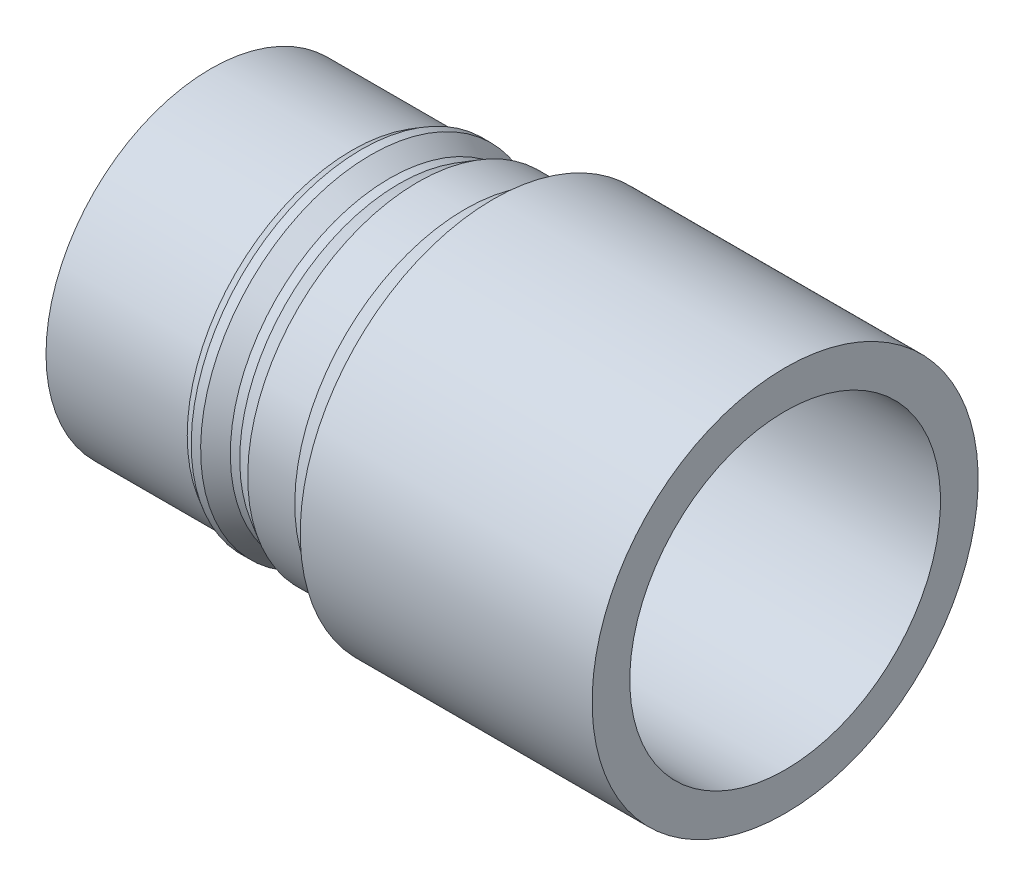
ISO-10303-21;
HEADER;
FILE_DESCRIPTION(('STEP AP214'),'2;1');
FILE_NAME('part.step','',(''),(''),'','','');
FILE_SCHEMA(('AUTOMOTIVE_DESIGN { 1 0 10303 214 1 1 1 1 }'));
ENDSEC;
DATA;
#1=APPLICATION_CONTEXT('core data for automotive mechanical design processes');
#2=APPLICATION_PROTOCOL_DEFINITION('international standard','automotive_design',2000,#1);
#3=PRODUCT_CONTEXT('',#1,'mechanical');
#4=PRODUCT('Part','Part','',(#3));
#5=PRODUCT_RELATED_PRODUCT_CATEGORY('part','',(#4));
#6=PRODUCT_DEFINITION_FORMATION('','',#4);
#7=PRODUCT_DEFINITION_CONTEXT('part definition',#1,'design');
#8=PRODUCT_DEFINITION('design','',#6,#7);
#9=PRODUCT_DEFINITION_SHAPE('','',#8);
#10=(LENGTH_UNIT() NAMED_UNIT(*) SI_UNIT(.MILLI.,.METRE.));
#11=(NAMED_UNIT(*) PLANE_ANGLE_UNIT() SI_UNIT($,.RADIAN.));
#12=(NAMED_UNIT(*) SI_UNIT($,.STERADIAN.) SOLID_ANGLE_UNIT());
#13=UNCERTAINTY_MEASURE_WITH_UNIT(LENGTH_MEASURE(1.E-05),#10,'distance_accuracy_value','');
#14=(GEOMETRIC_REPRESENTATION_CONTEXT(3) GLOBAL_UNCERTAINTY_ASSIGNED_CONTEXT((#13)) GLOBAL_UNIT_ASSIGNED_CONTEXT((#10,
#11,#12)) REPRESENTATION_CONTEXT('',''));
#15=CARTESIAN_POINT('',(0.,0.,0.));
#16=DIRECTION('',(0.,0.,1.));
#17=DIRECTION('',(1.,0.,0.));
#18=AXIS2_PLACEMENT_3D('',#15,#16,#17);
#19=CARTESIAN_POINT('',(0.,0.,0.));
#20=DIRECTION('',(-1.,0.,0.));
#21=DIRECTION('',(0.,-1.,0.));
#22=AXIS2_PLACEMENT_3D('',#19,#20,#21);
#23=PLANE('',#22);
#24=CARTESIAN_POINT('',(0.,0.,0.));
#25=DIRECTION('',(1.,0.,0.));
#26=DIRECTION('',(0.,1.,0.));
#27=AXIS2_PLACEMENT_3D('',#24,#25,#26);
#28=CIRCLE('',#27,16.5);
#29=CARTESIAN_POINT('',(0.,16.5,0.));
#30=VERTEX_POINT('',#29);
#31=EDGE_CURVE('E69',#30,#30,#28,.T.);
#32=ORIENTED_EDGE('',*,*,#31,.T.);
#33=EDGE_LOOP('',(#32));
#34=FACE_BOUND('',#33,.T.);
#35=CARTESIAN_POINT('',(0.,0.,0.));
#36=DIRECTION('',(1.,0.,0.));
#37=DIRECTION('',(0.,1.,0.));
#38=AXIS2_PLACEMENT_3D('',#35,#36,#37);
#39=CIRCLE('',#38,17.5);
#40=CARTESIAN_POINT('',(0.,17.5,0.));
#41=VERTEX_POINT('',#40);
#42=EDGE_CURVE('E10',#41,#41,#39,.T.);
#43=ORIENTED_EDGE('',*,*,#42,.F.);
#44=EDGE_LOOP('',(#43));
#45=FACE_BOUND('',#44,.T.);
#46=ADVANCED_FACE('F31',(#34,#45),#23,.T.);
#47=CARTESIAN_POINT('',(30.,0.,0.));
#48=DIRECTION('',(1.,0.,0.));
#49=DIRECTION('',(0.,1.,0.));
#50=AXIS2_PLACEMENT_3D('',#47,#48,#49);
#51=CYLINDRICAL_SURFACE('',#50,17.5);
#52=ORIENTED_EDGE('',*,*,#42,.T.);
#53=EDGE_LOOP('',(#52));
#54=FACE_BOUND('',#53,.T.);
#55=CARTESIAN_POINT('',(15.,0.,0.));
#56=DIRECTION('',(1.,0.,0.));
#57=DIRECTION('',(0.,1.,0.));
#58=AXIS2_PLACEMENT_3D('',#55,#56,#57);
#59=CIRCLE('',#58,17.5);
#60=CARTESIAN_POINT('',(15.,17.5,0.));
#61=VERTEX_POINT('',#60);
#62=EDGE_CURVE('E37',#61,#61,#59,.T.);
#63=ORIENTED_EDGE('',*,*,#62,.F.);
#64=EDGE_LOOP('',(#63));
#65=FACE_BOUND('',#64,.T.);
#66=ADVANCED_FACE('F106',(#54,#65),#51,.T.);
#67=CARTESIAN_POINT('',(16.,0.,0.));
#68=DIRECTION('',(1.,0.,0.));
#69=DIRECTION('',(0.,1.,0.));
#70=AXIS2_PLACEMENT_3D('',#67,#68,#69);
#71=CONICAL_SURFACE('',#70,18.0773502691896,0.523598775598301);
#72=ORIENTED_EDGE('',*,*,#62,.T.);
#73=EDGE_LOOP('',(#72));
#74=FACE_BOUND('',#73,.T.);
#75=CARTESIAN_POINT('',(16.,0.,0.));
#76=DIRECTION('',(1.,0.,0.));
#77=DIRECTION('',(0.,1.,0.));
#78=AXIS2_PLACEMENT_3D('',#75,#76,#77);
#79=CIRCLE('',#78,18.0773502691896);
#80=CARTESIAN_POINT('',(16.,18.0773502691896,0.));
#81=VERTEX_POINT('',#80);
#82=EDGE_CURVE('E41',#81,#81,#79,.T.);
#83=ORIENTED_EDGE('',*,*,#82,.F.);
#84=EDGE_LOOP('',(#83));
#85=FACE_BOUND('',#84,.T.);
#86=ADVANCED_FACE('F110',(#74,#85),#71,.T.);
#87=CARTESIAN_POINT('',(30.,0.,0.));
#88=DIRECTION('',(1.,0.,0.));
#89=DIRECTION('',(0.,1.,0.));
#90=AXIS2_PLACEMENT_3D('',#87,#88,#89);
#91=CYLINDRICAL_SURFACE('',#90,18.0773502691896);
#92=ORIENTED_EDGE('',*,*,#82,.T.);
#93=EDGE_LOOP('',(#92));
#94=FACE_BOUND('',#93,.T.);
#95=CARTESIAN_POINT('',(17.,0.,0.));
#96=DIRECTION('',(1.,0.,0.));
#97=DIRECTION('',(0.,1.,0.));
#98=AXIS2_PLACEMENT_3D('',#95,#96,#97);
#99=CIRCLE('',#98,18.0773502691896);
#100=CARTESIAN_POINT('',(17.,18.0773502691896,0.));
#101=VERTEX_POINT('',#100);
#102=EDGE_CURVE('E45',#101,#101,#99,.T.);
#103=ORIENTED_EDGE('',*,*,#102,.F.);
#104=EDGE_LOOP('',(#103));
#105=FACE_BOUND('',#104,.T.);
#106=ADVANCED_FACE('F114',(#94,#105),#91,.T.);
#107=CARTESIAN_POINT('',(19.,0.,0.));
#108=DIRECTION('',(-1.,0.,0.));
#109=DIRECTION('',(0.,-1.,0.));
#110=AXIS2_PLACEMENT_3D('',#107,#108,#109);
#111=CONICAL_SURFACE('',#110,16.9226497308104,0.523598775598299);
#112=ORIENTED_EDGE('',*,*,#102,.T.);
#113=EDGE_LOOP('',(#112));
#114=FACE_BOUND('',#113,.T.);
#115=CARTESIAN_POINT('',(19.,0.,0.));
#116=DIRECTION('',(1.,0.,0.));
#117=DIRECTION('',(0.,1.,0.));
#118=AXIS2_PLACEMENT_3D('',#115,#116,#117);
#119=CIRCLE('',#118,16.9226497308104);
#120=CARTESIAN_POINT('',(19.,16.9226497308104,0.));
#121=VERTEX_POINT('',#120);
#122=EDGE_CURVE('E50',#121,#121,#119,.T.);
#123=ORIENTED_EDGE('',*,*,#122,.F.);
#124=EDGE_LOOP('',(#123));
#125=FACE_BOUND('',#124,.T.);
#126=ADVANCED_FACE('F120',(#114,#125),#111,.T.);
#127=CARTESIAN_POINT('',(30.,0.,0.));
#128=DIRECTION('',(1.,0.,0.));
#129=DIRECTION('',(0.,1.,0.));
#130=AXIS2_PLACEMENT_3D('',#127,#128,#129);
#131=CYLINDRICAL_SURFACE('',#130,16.9226497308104);
#132=ORIENTED_EDGE('',*,*,#122,.T.);
#133=EDGE_LOOP('',(#132));
#134=FACE_BOUND('',#133,.T.);
#135=CARTESIAN_POINT('',(20.,0.,0.));
#136=DIRECTION('',(1.,0.,0.));
#137=DIRECTION('',(0.,1.,0.));
#138=AXIS2_PLACEMENT_3D('',#135,#136,#137);
#139=CIRCLE('',#138,16.9226497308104);
#140=CARTESIAN_POINT('',(20.,16.9226497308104,0.));
#141=VERTEX_POINT('',#140);
#142=EDGE_CURVE('E53',#141,#141,#139,.T.);
#143=ORIENTED_EDGE('',*,*,#142,.F.);
#144=EDGE_LOOP('',(#143));
#145=FACE_BOUND('',#144,.T.);
#146=ADVANCED_FACE('F124',(#134,#145),#131,.T.);
#147=CARTESIAN_POINT('',(22.,0.,0.));
#148=DIRECTION('',(1.,0.,0.));
#149=DIRECTION('',(0.,1.,0.));
#150=AXIS2_PLACEMENT_3D('',#147,#148,#149);
#151=CONICAL_SURFACE('',#150,18.0773502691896,0.523598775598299);
#152=ORIENTED_EDGE('',*,*,#142,.T.);
#153=EDGE_LOOP('',(#152));
#154=FACE_BOUND('',#153,.T.);
#155=CARTESIAN_POINT('',(22.,0.,0.));
#156=DIRECTION('',(1.,0.,0.));
#157=DIRECTION('',(0.,1.,0.));
#158=AXIS2_PLACEMENT_3D('',#155,#156,#157);
#159=CIRCLE('',#158,18.0773502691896);
#160=CARTESIAN_POINT('',(22.,18.0773502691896,0.));
#161=VERTEX_POINT('',#160);
#162=EDGE_CURVE('E56',#161,#161,#159,.T.);
#163=ORIENTED_EDGE('',*,*,#162,.F.);
#164=EDGE_LOOP('',(#163));
#165=FACE_BOUND('',#164,.T.);
#166=ADVANCED_FACE('F128',(#154,#165),#151,.T.);
#167=CARTESIAN_POINT('',(30.,0.,0.));
#168=DIRECTION('',(1.,0.,0.));
#169=DIRECTION('',(0.,1.,0.));
#170=AXIS2_PLACEMENT_3D('',#167,#168,#169);
#171=CYLINDRICAL_SURFACE('',#170,18.0773502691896);
#172=ORIENTED_EDGE('',*,*,#162,.T.);
#173=EDGE_LOOP('',(#172));
#174=FACE_BOUND('',#173,.T.);
#175=CARTESIAN_POINT('',(27.,0.,0.));
#176=DIRECTION('',(1.,0.,0.));
#177=DIRECTION('',(0.,1.,0.));
#178=AXIS2_PLACEMENT_3D('',#175,#176,#177);
#179=CIRCLE('',#178,18.0773502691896);
#180=CARTESIAN_POINT('',(27.,18.0773502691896,0.));
#181=VERTEX_POINT('',#180);
#182=EDGE_CURVE('E59',#181,#181,#179,.T.);
#183=ORIENTED_EDGE('',*,*,#182,.F.);
#184=EDGE_LOOP('',(#183));
#185=FACE_BOUND('',#184,.T.);
#186=ADVANCED_FACE('F132',(#174,#185),#171,.T.);
#187=CARTESIAN_POINT('',(30.,0.,0.));
#188=DIRECTION('',(1.,0.,0.));
#189=DIRECTION('',(0.,1.,0.));
#190=AXIS2_PLACEMENT_3D('',#187,#188,#189);
#191=CONICAL_SURFACE('',#190,19.0773502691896,0.321750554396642);
#192=ORIENTED_EDGE('',*,*,#182,.T.);
#193=EDGE_LOOP('',(#192));
#194=FACE_BOUND('',#193,.T.);
#195=CARTESIAN_POINT('',(30.,0.,0.));
#196=DIRECTION('',(1.,0.,0.));
#197=DIRECTION('',(0.,1.,0.));
#198=AXIS2_PLACEMENT_3D('',#195,#196,#197);
#199=CIRCLE('',#198,19.0773502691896);
#200=CARTESIAN_POINT('',(30.,19.0773502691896,0.));
#201=VERTEX_POINT('',#200);
#202=EDGE_CURVE('E62',#201,#201,#199,.T.);
#203=ORIENTED_EDGE('',*,*,#202,.F.);
#204=EDGE_LOOP('',(#203));
#205=FACE_BOUND('',#204,.T.);
#206=ADVANCED_FACE('F96',(#194,#205),#191,.T.);
#207=CARTESIAN_POINT('',(61.,0.,0.));
#208=DIRECTION('',(-1.,0.,0.));
#209=DIRECTION('',(0.,-1.,0.));
#210=AXIS2_PLACEMENT_3D('',#207,#208,#209);
#211=CYLINDRICAL_SURFACE('',#210,20.5);
#212=CARTESIAN_POINT('',(61.,0.,0.));
#213=DIRECTION('',(1.,0.,0.));
#214=DIRECTION('',(0.,1.,0.));
#215=AXIS2_PLACEMENT_3D('',#212,#213,#214);
#216=CIRCLE('',#215,20.5);
#217=CARTESIAN_POINT('',(61.,20.5,0.));
#218=VERTEX_POINT('',#217);
#219=EDGE_CURVE('E65',#218,#218,#216,.T.);
#220=ORIENTED_EDGE('',*,*,#219,.F.);
#221=EDGE_LOOP('',(#220));
#222=FACE_BOUND('',#221,.T.);
#223=CARTESIAN_POINT('',(30.,0.,0.));
#224=DIRECTION('',(1.,0.,0.));
#225=DIRECTION('',(0.,1.,0.));
#226=AXIS2_PLACEMENT_3D('',#223,#224,#225);
#227=CIRCLE('',#226,20.5);
#228=CARTESIAN_POINT('',(30.,20.5,0.));
#229=VERTEX_POINT('',#228);
#230=EDGE_CURVE('E66',#229,#229,#227,.T.);
#231=ORIENTED_EDGE('',*,*,#230,.T.);
#232=EDGE_LOOP('',(#231));
#233=FACE_BOUND('',#232,.T.);
#234=ADVANCED_FACE('F90',(#222,#233),#211,.T.);
#235=CARTESIAN_POINT('',(61.,0.,0.));
#236=DIRECTION('',(1.,0.,0.));
#237=DIRECTION('',(0.,1.,0.));
#238=AXIS2_PLACEMENT_3D('',#235,#236,#237);
#239=PLANE('',#238);
#240=CARTESIAN_POINT('',(61.,0.,0.));
#241=DIRECTION('',(1.,0.,0.));
#242=DIRECTION('',(0.,1.,0.));
#243=AXIS2_PLACEMENT_3D('',#240,#241,#242);
#244=CIRCLE('',#243,16.5);
#245=CARTESIAN_POINT('',(61.,16.5,0.));
#246=VERTEX_POINT('',#245);
#247=EDGE_CURVE('E72',#246,#246,#244,.T.);
#248=ORIENTED_EDGE('',*,*,#247,.F.);
#249=EDGE_LOOP('',(#248));
#250=FACE_BOUND('',#249,.T.);
#251=ORIENTED_EDGE('',*,*,#219,.T.);
#252=EDGE_LOOP('',(#251));
#253=FACE_BOUND('',#252,.T.);
#254=ADVANCED_FACE('F87',(#250,#253),#239,.T.);
#255=CARTESIAN_POINT('',(30.,0.,0.));
#256=DIRECTION('',(1.,0.,0.));
#257=DIRECTION('',(0.,1.,0.));
#258=AXIS2_PLACEMENT_3D('',#255,#256,#257);
#259=PLANE('',#258);
#260=ORIENTED_EDGE('',*,*,#202,.T.);
#261=EDGE_LOOP('',(#260));
#262=FACE_BOUND('',#261,.T.);
#263=ORIENTED_EDGE('',*,*,#230,.F.);
#264=EDGE_LOOP('',(#263));
#265=FACE_BOUND('',#264,.T.);
#266=ADVANCED_FACE('F83',(#262,#265),#259,.F.);
#267=CARTESIAN_POINT('',(0.,0.,0.));
#268=DIRECTION('',(1.,0.,0.));
#269=DIRECTION('',(0.,1.,0.));
#270=AXIS2_PLACEMENT_3D('',#267,#268,#269);
#271=CYLINDRICAL_SURFACE('',#270,16.5);
#272=ORIENTED_EDGE('',*,*,#31,.F.);
#273=EDGE_LOOP('',(#272));
#274=FACE_BOUND('',#273,.T.);
#275=ORIENTED_EDGE('',*,*,#247,.T.);
#276=EDGE_LOOP('',(#275));
#277=FACE_BOUND('',#276,.T.);
#278=ADVANCED_FACE('F80',(#274,#277),#271,.F.);
#279=CLOSED_SHELL('',(#46,#66,#86,#106,#126,#146,#166,#186,#206,#234,#254,#266,#278));
#280=MANIFOLD_SOLID_BREP('B2',#279);
#281=ADVANCED_BREP_SHAPE_REPRESENTATION('',(#18,#280),#14);
#282=SHAPE_DEFINITION_REPRESENTATION(#9,#281);
ENDSEC;
END-ISO-10303-21;
